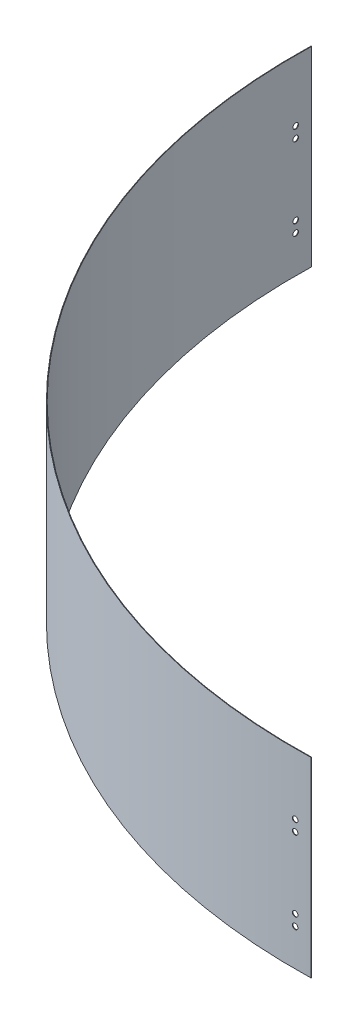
from build123d import *

# Parameters (mm, degrees)
EXTRUDE_THIN1_DEPTH      = 50
EXTRUDE_THIN1_DEPTH_BACK = 20
SKETCH1_R                = 220.2
SKETCH1_R_2              = 220
SKETCH2_R                = 1
CUT_EXTRUDE1_DEPTH       = 316.398287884
CIRPATTERN1_COUNT        = 4
CUT_EXTRUDE2_DEPTH       = 316.39828804
CUT_EXTRUDE2_DEPTH_BACK  = 316.39828804


with BuildPart() as part:
    # Sketch1 → Extrude-Thin1 (new, two sides: drawn at the far end of the back side and taken through both)
    with BuildSketch(Plane(origin=(0, 0, 0), x_dir=(1, 0, 0), z_dir=(0, 1, 0)).offset(-EXTRUDE_THIN1_DEPTH_BACK)):
        Circle(SKETCH1_R)
        Circle(SKETCH1_R_2, mode=Mode.SUBTRACT)
    extrude(amount=EXTRUDE_THIN1_DEPTH + EXTRUDE_THIN1_DEPTH_BACK)

    # Sketch2 → Cut-Extrude1 (cut, symmetric)
    with BuildSketch(Plane.XY):
        with Locations((0, -2.45)):
            Circle(SKETCH2_R)
        with Locations((0, -6.45)):
            Circle(SKETCH2_R)
        with Locations((0, 27.55)):
            Circle(SKETCH2_R)
        with Locations((0, 23.55)):
            Circle(SKETCH2_R)
    cut_extrude1 = extrude(amount=CUT_EXTRUDE1_DEPTH, both=True, mode=Mode.SUBTRACT)

    # CirPattern1: Cut-Extrude1 ×4 about axis
    cirpattern1_axis = Axis((0, -20, 0), (0, 1, 0))
    for i in range(1, CIRPATTERN1_COUNT):
        add(cut_extrude1.rotate(cirpattern1_axis, i * 360 / CIRPATTERN1_COUNT), mode=Mode.SUBTRACT)

    # Sketch3 → Cut-Extrude2 (cut, two sides: drawn at the far end of the back side and taken through both)
    with BuildSketch(Plane(origin=(0, 0, 0), x_dir=(1, 0, 0), z_dir=(0, 1, 0)).offset(-CUT_EXTRUDE2_DEPTH_BACK)):
        Polygon((0, 0), (-294.947923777, 7.723483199), (-294.947923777, 295.504312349), (297.06495097, 295.504312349), (297.06495097, -375.260009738), (9.826529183, -375.260009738), align=None)
    extrude(amount=CUT_EXTRUDE2_DEPTH + CUT_EXTRUDE2_DEPTH_BACK, mode=Mode.SUBTRACT)


solid = part.part
